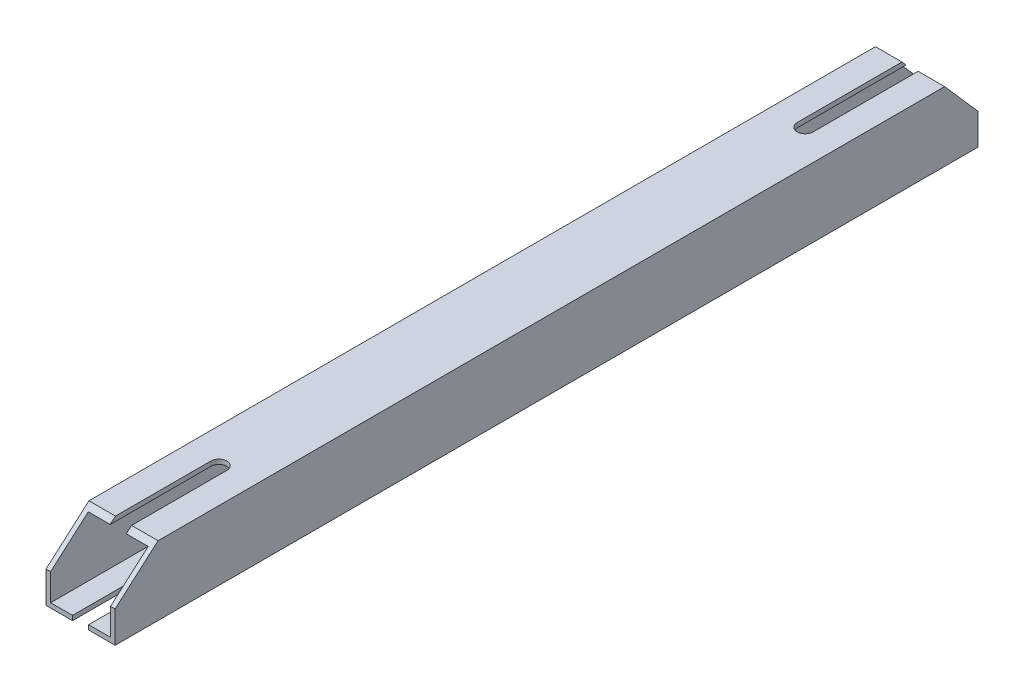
ISO-10303-21;
HEADER;
FILE_DESCRIPTION(('STEP AP214'),'2;1');
FILE_NAME('part.step','',(''),(''),'','','');
FILE_SCHEMA(('AUTOMOTIVE_DESIGN { 1 0 10303 214 1 1 1 1 }'));
ENDSEC;
DATA;
#1=APPLICATION_CONTEXT('core data for automotive mechanical design processes');
#2=APPLICATION_PROTOCOL_DEFINITION('international standard','automotive_design',2000,#1);
#3=PRODUCT_CONTEXT('',#1,'mechanical');
#4=PRODUCT('Part','Part','',(#3));
#5=PRODUCT_RELATED_PRODUCT_CATEGORY('part','',(#4));
#6=PRODUCT_DEFINITION_FORMATION('','',#4);
#7=PRODUCT_DEFINITION_CONTEXT('part definition',#1,'design');
#8=PRODUCT_DEFINITION('design','',#6,#7);
#9=PRODUCT_DEFINITION_SHAPE('','',#8);
#10=(LENGTH_UNIT() NAMED_UNIT(*) SI_UNIT(.MILLI.,.METRE.));
#11=(NAMED_UNIT(*) PLANE_ANGLE_UNIT() SI_UNIT($,.RADIAN.));
#12=(NAMED_UNIT(*) SI_UNIT($,.STERADIAN.) SOLID_ANGLE_UNIT());
#13=UNCERTAINTY_MEASURE_WITH_UNIT(LENGTH_MEASURE(1.E-05),#10,'distance_accuracy_value','');
#14=(GEOMETRIC_REPRESENTATION_CONTEXT(3) GLOBAL_UNCERTAINTY_ASSIGNED_CONTEXT((#13)) GLOBAL_UNIT_ASSIGNED_CONTEXT((#10,
#11,#12)) REPRESENTATION_CONTEXT('',''));
#15=CARTESIAN_POINT('',(0.,0.,0.));
#16=DIRECTION('',(0.,0.,1.));
#17=DIRECTION('',(1.,0.,0.));
#18=AXIS2_PLACEMENT_3D('',#15,#16,#17);
#19=CARTESIAN_POINT('',(7.,-40.,628.8099128));
#20=DIRECTION('',(1.,0.,0.));
#21=DIRECTION('',(0.,1.,0.));
#22=AXIS2_PLACEMENT_3D('',#19,#20,#21);
#23=PLANE('',#22);
#24=DIRECTION('',(0.,-0.659323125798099,0.751859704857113));
#25=VECTOR('',#24,1.);
#26=CARTESIAN_POINT('',(7.,233.82526622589,479.13365130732));
#27=LINE('',#26,#25);
#28=CARTESIAN_POINT('',(7.,30.,711.56597244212));
#29=VERTEX_POINT('',#28);
#30=CARTESIAN_POINT('',(7.,26.,716.12737595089));
#31=VERTEX_POINT('',#30);
#32=EDGE_CURVE('E394',#29,#31,#27,.T.);
#33=ORIENTED_EDGE('',*,*,#32,.F.);
#34=DIRECTION('',(0.,0.,1.));
#35=VECTOR('',#34,1.);
#36=CARTESIAN_POINT('',(7.,30.,314.4049564));
#37=LINE('',#36,#35);
#38=CARTESIAN_POINT('',(7.,30.,628.8099128));
#39=VERTEX_POINT('',#38);
#40=EDGE_CURVE('E171',#39,#29,#37,.T.);
#41=ORIENTED_EDGE('',*,*,#40,.F.);
#42=DIRECTION('',(0.,1.,0.));
#43=VECTOR('',#42,1.);
#44=CARTESIAN_POINT('',(7.,-40.,628.8099128));
#45=LINE('',#44,#43);
#46=CARTESIAN_POINT('',(7.,26.,628.8099128));
#47=VERTEX_POINT('',#46);
#48=EDGE_CURVE('E10',#47,#39,#45,.T.);
#49=ORIENTED_EDGE('',*,*,#48,.F.);
#50=DIRECTION('',(0.,0.,1.));
#51=VECTOR('',#50,1.);
#52=CARTESIAN_POINT('',(7.,26.,314.4049564));
#53=LINE('',#52,#51);
#54=EDGE_CURVE('E168',#47,#31,#53,.T.);
#55=ORIENTED_EDGE('',*,*,#54,.T.);
#56=EDGE_LOOP('',(#33,#41,#49,#55));
#57=FACE_BOUND('',#56,.T.);
#58=ADVANCED_FACE('F16',(#57),#23,.F.);
#59=CARTESIAN_POINT('',(0.,-40.,628.8099128));
#60=DIRECTION('',(0.,1.,0.));
#61=DIRECTION('',(0.,0.,1.));
#62=AXIS2_PLACEMENT_3D('',#59,#60,#61);
#63=CYLINDRICAL_SURFACE('',#62,7.);
#64=CARTESIAN_POINT('',(0.,30.,628.8099128));
#65=DIRECTION('',(0.,1.,0.));
#66=DIRECTION('',(0.,0.,1.));
#67=AXIS2_PLACEMENT_3D('',#64,#65,#66);
#68=CIRCLE('',#67,7.);
#69=CARTESIAN_POINT('',(-7.,30.,628.8099128));
#70=VERTEX_POINT('',#69);
#71=EDGE_CURVE('E447',#39,#70,#68,.T.);
#72=ORIENTED_EDGE('',*,*,#71,.T.);
#73=DIRECTION('',(0.,1.,0.));
#74=VECTOR('',#73,1.);
#75=CARTESIAN_POINT('',(-7.,-40.,628.8099128));
#76=LINE('',#75,#74);
#77=CARTESIAN_POINT('',(-7.,26.,628.8099128));
#78=VERTEX_POINT('',#77);
#79=EDGE_CURVE('E26',#78,#70,#76,.T.);
#80=ORIENTED_EDGE('',*,*,#79,.F.);
#81=CARTESIAN_POINT('',(0.,26.,628.8099128));
#82=DIRECTION('',(0.,1.,0.));
#83=DIRECTION('',(0.,0.,1.));
#84=AXIS2_PLACEMENT_3D('',#81,#82,#83);
#85=CIRCLE('',#84,7.);
#86=EDGE_CURVE('E176',#47,#78,#85,.T.);
#87=ORIENTED_EDGE('',*,*,#86,.F.);
#88=ORIENTED_EDGE('',*,*,#48,.T.);
#89=EDGE_LOOP('',(#72,#80,#87,#88));
#90=FACE_BOUND('',#89,.T.);
#91=ADVANCED_FACE('F18',(#90),#63,.F.);
#92=CARTESIAN_POINT('',(-7.,-40.,628.8099128));
#93=DIRECTION('',(1.,0.,0.));
#94=DIRECTION('',(0.,1.,0.));
#95=AXIS2_PLACEMENT_3D('',#92,#93,#94);
#96=PLANE('',#95);
#97=DIRECTION('',(0.,0.,1.));
#98=VECTOR('',#97,1.);
#99=CARTESIAN_POINT('',(-7.,26.,314.4049564));
#100=LINE('',#99,#98);
#101=CARTESIAN_POINT('',(-7.,26.,716.12737595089));
#102=VERTEX_POINT('',#101);
#103=EDGE_CURVE('E180',#78,#102,#100,.T.);
#104=ORIENTED_EDGE('',*,*,#103,.F.);
#105=ORIENTED_EDGE('',*,*,#79,.T.);
#106=DIRECTION('',(0.,0.,1.));
#107=VECTOR('',#106,1.);
#108=CARTESIAN_POINT('',(-7.,30.,314.4049564));
#109=LINE('',#108,#107);
#110=CARTESIAN_POINT('',(-7.,30.,711.56597244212));
#111=VERTEX_POINT('',#110);
#112=EDGE_CURVE('E443',#70,#111,#109,.T.);
#113=ORIENTED_EDGE('',*,*,#112,.T.);
#114=DIRECTION('',(0.,-0.659323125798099,0.751859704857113));
#115=VECTOR('',#114,1.);
#116=CARTESIAN_POINT('',(-7.,233.82526622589,479.13365130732));
#117=LINE('',#116,#115);
#118=EDGE_CURVE('E237',#111,#102,#117,.T.);
#119=ORIENTED_EDGE('',*,*,#118,.T.);
#120=EDGE_LOOP('',(#104,#105,#113,#119));
#121=FACE_BOUND('',#120,.T.);
#122=ADVANCED_FACE('F467',(#121),#96,.T.);
#123=CARTESIAN_POINT('',(0.,-40.,120.));
#124=DIRECTION('',(0.,1.,0.));
#125=DIRECTION('',(0.,0.,1.));
#126=AXIS2_PLACEMENT_3D('',#123,#124,#125);
#127=CYLINDRICAL_SURFACE('',#126,7.);
#128=CARTESIAN_POINT('',(0.,26.,120.));
#129=DIRECTION('',(0.,1.,0.));
#130=DIRECTION('',(0.,0.,1.));
#131=AXIS2_PLACEMENT_3D('',#128,#129,#130);
#132=CIRCLE('',#131,7.);
#133=CARTESIAN_POINT('',(-7.,26.,120.));
#134=VERTEX_POINT('',#133);
#135=CARTESIAN_POINT('',(0.,26.,127.));
#136=VERTEX_POINT('',#135);
#137=EDGE_CURVE('E159',#134,#136,#132,.T.);
#138=ORIENTED_EDGE('',*,*,#137,.F.);
#139=DIRECTION('',(0.,1.,0.));
#140=VECTOR('',#139,1.);
#141=CARTESIAN_POINT('',(-7.,-40.,120.));
#142=LINE('',#141,#140);
#143=CARTESIAN_POINT('',(-7.,30.,120.));
#144=VERTEX_POINT('',#143);
#145=EDGE_CURVE('E193',#134,#144,#142,.T.);
#146=ORIENTED_EDGE('',*,*,#145,.T.);
#147=CARTESIAN_POINT('',(0.,30.,120.));
#148=DIRECTION('',(0.,1.,0.));
#149=DIRECTION('',(0.,0.,1.));
#150=AXIS2_PLACEMENT_3D('',#147,#148,#149);
#151=CIRCLE('',#150,7.);
#152=CARTESIAN_POINT('',(0.,30.,127.));
#153=VERTEX_POINT('',#152);
#154=EDGE_CURVE('E310',#144,#153,#151,.T.);
#155=ORIENTED_EDGE('',*,*,#154,.T.);
#156=DIRECTION('',(0.,1.,0.));
#157=VECTOR('',#156,1.);
#158=CARTESIAN_POINT('',(0.,-40.,127.));
#159=LINE('',#158,#157);
#160=EDGE_CURVE('E426',#136,#153,#159,.T.);
#161=ORIENTED_EDGE('',*,*,#160,.F.);
#162=EDGE_LOOP('',(#138,#146,#155,#161));
#163=FACE_BOUND('',#162,.T.);
#164=ADVANCED_FACE('F769',(#163),#127,.F.);
#165=CARTESIAN_POINT('',(0.,-40.,120.));
#166=DIRECTION('',(0.,1.,0.));
#167=DIRECTION('',(0.,0.,1.));
#168=AXIS2_PLACEMENT_3D('',#165,#166,#167);
#169=CYLINDRICAL_SURFACE('',#168,7.);
#170=DIRECTION('',(0.,1.,0.));
#171=VECTOR('',#170,1.);
#172=CARTESIAN_POINT('',(7.,-40.,120.));
#173=LINE('',#172,#171);
#174=CARTESIAN_POINT('',(7.,26.,120.));
#175=VERTEX_POINT('',#174);
#176=CARTESIAN_POINT('',(7.,30.,120.));
#177=VERTEX_POINT('',#176);
#178=EDGE_CURVE('E39',#175,#177,#173,.T.);
#179=ORIENTED_EDGE('',*,*,#178,.F.);
#180=CARTESIAN_POINT('',(0.,26.,120.));
#181=DIRECTION('',(0.,1.,0.));
#182=DIRECTION('',(0.,0.,1.));
#183=AXIS2_PLACEMENT_3D('',#180,#181,#182);
#184=CIRCLE('',#183,7.);
#185=EDGE_CURVE('E460',#136,#175,#184,.T.);
#186=ORIENTED_EDGE('',*,*,#185,.F.);
#187=ORIENTED_EDGE('',*,*,#160,.T.);
#188=CARTESIAN_POINT('',(0.,30.,120.));
#189=DIRECTION('',(0.,1.,0.));
#190=DIRECTION('',(0.,0.,1.));
#191=AXIS2_PLACEMENT_3D('',#188,#189,#190);
#192=CIRCLE('',#191,7.);
#193=EDGE_CURVE('E435',#153,#177,#192,.T.);
#194=ORIENTED_EDGE('',*,*,#193,.T.);
#195=EDGE_LOOP('',(#179,#186,#187,#194));
#196=FACE_BOUND('',#195,.T.);
#197=ADVANCED_FACE('F765',(#196),#169,.F.);
#198=CARTESIAN_POINT('',(7.,-40.,-1.));
#199=DIRECTION('',(1.,0.,0.));
#200=DIRECTION('',(0.,1.,0.));
#201=AXIS2_PLACEMENT_3D('',#198,#199,#200);
#202=PLANE('',#201);
#203=DIRECTION('',(0.,0.,1.));
#204=VECTOR('',#203,1.);
#205=CARTESIAN_POINT('',(7.,30.,-0.5));
#206=LINE('',#205,#204);
#207=CARTESIAN_POINT('',(7.,30.,28.967763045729));
#208=VERTEX_POINT('',#207);
#209=EDGE_CURVE('E431',#208,#177,#206,.T.);
#210=ORIENTED_EDGE('',*,*,#209,.F.);
#211=DIRECTION('',(0.,-0.751859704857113,-0.659323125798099));
#212=VECTOR('',#211,1.);
#213=CARTESIAN_POINT('',(7.,-12.87236581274,-8.628003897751));
#214=LINE('',#213,#212);
#215=CARTESIAN_POINT('',(7.,26.,25.460070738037));
#216=VERTEX_POINT('',#215);
#217=EDGE_CURVE('E207',#208,#216,#214,.T.);
#218=ORIENTED_EDGE('',*,*,#217,.T.);
#219=DIRECTION('',(0.,0.,1.));
#220=VECTOR('',#219,1.);
#221=CARTESIAN_POINT('',(7.,26.,-0.5));
#222=LINE('',#221,#220);
#223=EDGE_CURVE('E427',#216,#175,#222,.T.);
#224=ORIENTED_EDGE('',*,*,#223,.T.);
#225=ORIENTED_EDGE('',*,*,#178,.T.);
#226=EDGE_LOOP('',(#210,#218,#224,#225));
#227=FACE_BOUND('',#226,.T.);
#228=ADVANCED_FACE('F762',(#227),#202,.F.);
#229=CARTESIAN_POINT('',(26.,26.,0.));
#230=DIRECTION('',(0.,-1.,0.));
#231=DIRECTION('',(0.,0.,-1.));
#232=AXIS2_PLACEMENT_3D('',#229,#230,#231);
#233=PLANE('',#232);
#234=DIRECTION('',(-1.,0.,0.));
#235=VECTOR('',#234,1.);
#236=CARTESIAN_POINT('',(13.,26.,25.460070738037));
#237=LINE('',#236,#235);
#238=CARTESIAN_POINT('',(26.,26.,25.460070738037));
#239=VERTEX_POINT('',#238);
#240=EDGE_CURVE('E203',#239,#216,#237,.T.);
#241=ORIENTED_EDGE('',*,*,#240,.F.);
#242=DIRECTION('',(0.,0.,1.));
#243=VECTOR('',#242,1.);
#244=CARTESIAN_POINT('',(26.,26.,0.));
#245=LINE('',#244,#243);
#246=CARTESIAN_POINT('',(26.,26.,716.12737595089));
#247=VERTEX_POINT('',#246);
#248=EDGE_CURVE('E221',#239,#247,#245,.T.);
#249=ORIENTED_EDGE('',*,*,#248,.T.);
#250=DIRECTION('',(-1.,0.,0.));
#251=VECTOR('',#250,1.);
#252=CARTESIAN_POINT('',(-12.,26.,716.12737595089));
#253=LINE('',#252,#251);
#254=EDGE_CURVE('E184',#247,#31,#253,.T.);
#255=ORIENTED_EDGE('',*,*,#254,.T.);
#256=ORIENTED_EDGE('',*,*,#54,.F.);
#257=ORIENTED_EDGE('',*,*,#86,.T.);
#258=ORIENTED_EDGE('',*,*,#103,.T.);
#259=DIRECTION('',(-1.,0.,0.));
#260=VECTOR('',#259,1.);
#261=CARTESIAN_POINT('',(-12.,26.,716.12737595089));
#262=LINE('',#261,#260);
#263=CARTESIAN_POINT('',(-26.,26.,716.12737595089));
#264=VERTEX_POINT('',#263);
#265=EDGE_CURVE('E241',#102,#264,#262,.T.);
#266=ORIENTED_EDGE('',*,*,#265,.T.);
#267=DIRECTION('',(0.,0.,1.));
#268=VECTOR('',#267,1.);
#269=CARTESIAN_POINT('',(-26.,26.,0.));
#270=LINE('',#269,#268);
#271=CARTESIAN_POINT('',(-26.,26.,25.460070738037));
#272=VERTEX_POINT('',#271);
#273=EDGE_CURVE('E213',#272,#264,#270,.T.);
#274=ORIENTED_EDGE('',*,*,#273,.F.);
#275=DIRECTION('',(-1.,0.,0.));
#276=VECTOR('',#275,1.);
#277=CARTESIAN_POINT('',(13.,26.,25.460070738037));
#278=LINE('',#277,#276);
#279=CARTESIAN_POINT('',(-7.,26.,25.460070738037));
#280=VERTEX_POINT('',#279);
#281=EDGE_CURVE('E332',#280,#272,#278,.T.);
#282=ORIENTED_EDGE('',*,*,#281,.F.);
#283=DIRECTION('',(0.,0.,1.));
#284=VECTOR('',#283,1.);
#285=CARTESIAN_POINT('',(-7.,26.,-0.5));
#286=LINE('',#285,#284);
#287=EDGE_CURVE('E187',#280,#134,#286,.T.);
#288=ORIENTED_EDGE('',*,*,#287,.T.);
#289=ORIENTED_EDGE('',*,*,#137,.T.);
#290=ORIENTED_EDGE('',*,*,#185,.T.);
#291=ORIENTED_EDGE('',*,*,#223,.F.);
#292=EDGE_LOOP('',(#241,#249,#255,#256,#257,#258,#266,#274,#282,#288,#289,#290,#291));
#293=FACE_BOUND('',#292,.T.);
#294=ADVANCED_FACE('F182',(#293),#233,.T.);
#295=CARTESIAN_POINT('',(-7.,-40.,-1.));
#296=DIRECTION('',(1.,0.,0.));
#297=DIRECTION('',(0.,1.,0.));
#298=AXIS2_PLACEMENT_3D('',#295,#296,#297);
#299=PLANE('',#298);
#300=ORIENTED_EDGE('',*,*,#145,.F.);
#301=ORIENTED_EDGE('',*,*,#287,.F.);
#302=DIRECTION('',(0.,-0.751859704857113,-0.659323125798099));
#303=VECTOR('',#302,1.);
#304=CARTESIAN_POINT('',(-7.,-12.87236581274,-8.628003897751));
#305=LINE('',#304,#303);
#306=CARTESIAN_POINT('',(-7.,30.,28.967763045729));
#307=VERTEX_POINT('',#306);
#308=EDGE_CURVE('E355',#307,#280,#305,.T.);
#309=ORIENTED_EDGE('',*,*,#308,.F.);
#310=DIRECTION('',(0.,0.,1.));
#311=VECTOR('',#310,1.);
#312=CARTESIAN_POINT('',(-7.,30.,-0.5));
#313=LINE('',#312,#311);
#314=EDGE_CURVE('E305',#307,#144,#313,.T.);
#315=ORIENTED_EDGE('',*,*,#314,.T.);
#316=EDGE_LOOP('',(#300,#301,#309,#315));
#317=FACE_BOUND('',#316,.T.);
#318=ADVANCED_FACE('F740',(#317),#299,.T.);
#319=CARTESIAN_POINT('',(-50.,427.05631235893,258.7824583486));
#320=DIRECTION('',(0.,0.751859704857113,0.659323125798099));
#321=DIRECTION('',(1.,0.,0.));
#322=AXIS2_PLACEMENT_3D('',#319,#320,#321);
#323=PLANE('',#322);
#324=DIRECTION('',(-1.,0.,0.));
#325=VECTOR('',#324,1.);
#326=CARTESIAN_POINT('',(-25.,-2.66007077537,748.8099128));
#327=LINE('',#326,#325);
#328=CARTESIAN_POINT('',(-26.,-2.66007077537,748.8099128));
#329=VERTEX_POINT('',#328);
#330=CARTESIAN_POINT('',(-30.,-2.66007077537,748.8099128));
#331=VERTEX_POINT('',#330);
#332=EDGE_CURVE('E371',#329,#331,#327,.T.);
#333=ORIENTED_EDGE('',*,*,#332,.F.);
#334=DIRECTION('',(0.,-0.659323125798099,0.751859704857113));
#335=VECTOR('',#334,1.);
#336=CARTESIAN_POINT('',(-26.,404.02694718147,285.04401512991));
#337=LINE('',#336,#335);
#338=EDGE_CURVE('E209',#264,#329,#337,.T.);
#339=ORIENTED_EDGE('',*,*,#338,.F.);
#340=ORIENTED_EDGE('',*,*,#265,.F.);
#341=ORIENTED_EDGE('',*,*,#118,.F.);
#342=DIRECTION('',(-1.,0.,0.));
#343=VECTOR('',#342,1.);
#344=CARTESIAN_POINT('',(-10.,30.,711.56597244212));
#345=LINE('',#344,#343);
#346=CARTESIAN_POINT('',(-30.,30.,711.56597244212));
#347=VERTEX_POINT('',#346);
#348=EDGE_CURVE('E309',#111,#347,#345,.T.);
#349=ORIENTED_EDGE('',*,*,#348,.T.);
#350=DIRECTION('',(0.,-0.659323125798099,0.751859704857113));
#351=VECTOR('',#350,1.);
#352=CARTESIAN_POINT('',(-30.,404.8963611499,284.05257814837));
#353=LINE('',#352,#351);
#354=EDGE_CURVE('E386',#347,#331,#353,.T.);
#355=ORIENTED_EDGE('',*,*,#354,.T.);
#356=EDGE_LOOP('',(#333,#339,#340,#341,#349,#355));
#357=FACE_BOUND('',#356,.T.);
#358=ADVANCED_FACE('F747',(#357),#323,.T.);
#359=CARTESIAN_POINT('',(-50.,427.05631235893,258.7824583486));
#360=DIRECTION('',(0.,0.751859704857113,0.659323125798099));
#361=DIRECTION('',(1.,0.,0.));
#362=AXIS2_PLACEMENT_3D('',#359,#360,#361);
#363=PLANE('',#362);
#364=DIRECTION('',(-1.,0.,0.));
#365=VECTOR('',#364,1.);
#366=CARTESIAN_POINT('',(-25.,-2.66007077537,748.8099128));
#367=LINE('',#366,#365);
#368=CARTESIAN_POINT('',(30.,-2.66007077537,748.8099128));
#369=VERTEX_POINT('',#368);
#370=CARTESIAN_POINT('',(26.,-2.66007077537,748.8099128));
#371=VERTEX_POINT('',#370);
#372=EDGE_CURVE('E344',#369,#371,#367,.T.);
#373=ORIENTED_EDGE('',*,*,#372,.F.);
#374=DIRECTION('',(0.,0.659323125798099,-0.751859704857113));
#375=VECTOR('',#374,1.);
#376=CARTESIAN_POINT('',(30.,391.85515162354,298.92413287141));
#377=LINE('',#376,#375);
#378=CARTESIAN_POINT('',(30.,30.,711.56597244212));
#379=VERTEX_POINT('',#378);
#380=EDGE_CURVE('E327',#369,#379,#377,.T.);
#381=ORIENTED_EDGE('',*,*,#380,.T.);
#382=DIRECTION('',(-1.,0.,0.));
#383=VECTOR('',#382,1.);
#384=CARTESIAN_POINT('',(-10.,30.,711.56597244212));
#385=LINE('',#384,#383);
#386=EDGE_CURVE('E390',#379,#29,#385,.T.);
#387=ORIENTED_EDGE('',*,*,#386,.T.);
#388=ORIENTED_EDGE('',*,*,#32,.T.);
#389=ORIENTED_EDGE('',*,*,#254,.F.);
#390=DIRECTION('',(0.,0.659323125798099,-0.751859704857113));
#391=VECTOR('',#390,1.);
#392=CARTESIAN_POINT('',(26.,392.72456559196,297.93269588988));
#393=LINE('',#392,#391);
#394=EDGE_CURVE('E414',#371,#247,#393,.T.);
#395=ORIENTED_EDGE('',*,*,#394,.F.);
#396=EDGE_LOOP('',(#373,#381,#387,#388,#389,#395));
#397=FACE_BOUND('',#396,.T.);
#398=ADVANCED_FACE('F750',(#397),#363,.T.);
#399=CARTESIAN_POINT('',(30.,30.,0.));
#400=DIRECTION('',(0.,-1.,0.));
#401=DIRECTION('',(0.,0.,-1.));
#402=AXIS2_PLACEMENT_3D('',#399,#400,#401);
#403=PLANE('',#402);
#404=ORIENTED_EDGE('',*,*,#209,.T.);
#405=ORIENTED_EDGE('',*,*,#193,.F.);
#406=ORIENTED_EDGE('',*,*,#154,.F.);
#407=ORIENTED_EDGE('',*,*,#314,.F.);
#408=DIRECTION('',(-1.,0.,0.));
#409=VECTOR('',#408,1.);
#410=CARTESIAN_POINT('',(15.,30.,28.967763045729));
#411=LINE('',#410,#409);
#412=CARTESIAN_POINT('',(-30.,30.,28.967763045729));
#413=VERTEX_POINT('',#412);
#414=EDGE_CURVE('E402',#307,#413,#411,.T.);
#415=ORIENTED_EDGE('',*,*,#414,.T.);
#416=DIRECTION('',(0.,0.,1.));
#417=VECTOR('',#416,1.);
#418=CARTESIAN_POINT('',(-30.,30.,0.));
#419=LINE('',#418,#417);
#420=EDGE_CURVE('E389',#413,#347,#419,.T.);
#421=ORIENTED_EDGE('',*,*,#420,.T.);
#422=ORIENTED_EDGE('',*,*,#348,.F.);
#423=ORIENTED_EDGE('',*,*,#112,.F.);
#424=ORIENTED_EDGE('',*,*,#71,.F.);
#425=ORIENTED_EDGE('',*,*,#40,.T.);
#426=ORIENTED_EDGE('',*,*,#386,.F.);
#427=DIRECTION('',(0.,0.,1.));
#428=VECTOR('',#427,1.);
#429=CARTESIAN_POINT('',(30.,30.,0.));
#430=LINE('',#429,#428);
#431=CARTESIAN_POINT('',(30.,30.,28.967763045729));
#432=VERTEX_POINT('',#431);
#433=EDGE_CURVE('E323',#432,#379,#430,.T.);
#434=ORIENTED_EDGE('',*,*,#433,.F.);
#435=DIRECTION('',(-1.,0.,0.));
#436=VECTOR('',#435,1.);
#437=CARTESIAN_POINT('',(15.,30.,28.967763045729));
#438=LINE('',#437,#436);
#439=EDGE_CURVE('E423',#432,#208,#438,.T.);
#440=ORIENTED_EDGE('',*,*,#439,.T.);
#441=EDGE_LOOP('',(#404,#405,#406,#407,#415,#421,#422,#423,#424,#425,#426,#434,#440));
#442=FACE_BOUND('',#441,.T.);
#443=ADVANCED_FACE('F471',(#442),#403,.F.);
#444=CARTESIAN_POINT('',(0.,-1.318646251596,1.503719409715));
#445=DIRECTION('',(0.,-0.659323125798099,0.751859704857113));
#446=DIRECTION('',(-1.,0.,0.));
#447=AXIS2_PLACEMENT_3D('',#444,#445,#446);
#448=PLANE('',#447);
#449=ORIENTED_EDGE('',*,*,#240,.T.);
#450=ORIENTED_EDGE('',*,*,#217,.F.);
#451=ORIENTED_EDGE('',*,*,#439,.F.);
#452=DIRECTION('',(0.,0.751859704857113,0.659323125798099));
#453=VECTOR('',#452,1.);
#454=CARTESIAN_POINT('',(30.,-9.798041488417,-5.932057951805));
#455=LINE('',#454,#453);
#456=CARTESIAN_POINT('',(30.,-3.033413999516,0.));
#457=VERTEX_POINT('',#456);
#458=EDGE_CURVE('E282',#457,#432,#455,.T.);
#459=ORIENTED_EDGE('',*,*,#458,.F.);
#460=DIRECTION('',(1.,0.,0.));
#461=VECTOR('',#460,1.);
#462=CARTESIAN_POINT('',(0.,-3.033413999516,0.));
#463=LINE('',#462,#461);
#464=CARTESIAN_POINT('',(26.,-3.033413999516,0.));
#465=VERTEX_POINT('',#464);
#466=EDGE_CURVE('E283',#465,#457,#463,.T.);
#467=ORIENTED_EDGE('',*,*,#466,.F.);
#468=DIRECTION('',(0.,0.751859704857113,0.659323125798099));
#469=VECTOR('',#468,1.);
#470=CARTESIAN_POINT('',(26.,-8.667455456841,-4.940620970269));
#471=LINE('',#470,#469);
#472=EDGE_CURVE('E208',#465,#239,#471,.T.);
#473=ORIENTED_EDGE('',*,*,#472,.T.);
#474=EDGE_LOOP('',(#449,#450,#451,#459,#467,#473));
#475=FACE_BOUND('',#474,.T.);
#476=ADVANCED_FACE('F826',(#475),#448,.F.);
#477=CARTESIAN_POINT('',(26.,-26.,0.));
#478=DIRECTION('',(-1.,0.,0.));
#479=DIRECTION('',(0.,0.,1.));
#480=AXIS2_PLACEMENT_3D('',#477,#478,#479);
#481=PLANE('',#480);
#482=DIRECTION('',(0.,1.,0.));
#483=VECTOR('',#482,1.);
#484=CARTESIAN_POINT('',(26.,-26.,0.));
#485=LINE('',#484,#483);
#486=CARTESIAN_POINT('',(26.,-26.,0.));
#487=VERTEX_POINT('',#486);
#488=EDGE_CURVE('E301',#487,#465,#485,.T.);
#489=ORIENTED_EDGE('',*,*,#488,.F.);
#490=DIRECTION('',(0.,0.,1.));
#491=VECTOR('',#490,1.);
#492=CARTESIAN_POINT('',(26.,-26.,0.));
#493=LINE('',#492,#491);
#494=CARTESIAN_POINT('',(26.,-26.,748.8099128));
#495=VERTEX_POINT('',#494);
#496=EDGE_CURVE('E413',#487,#495,#493,.T.);
#497=ORIENTED_EDGE('',*,*,#496,.T.);
#498=DIRECTION('',(0.,1.,0.));
#499=VECTOR('',#498,1.);
#500=CARTESIAN_POINT('',(26.,-26.,748.8099128));
#501=LINE('',#500,#499);
#502=EDGE_CURVE('E348',#495,#371,#501,.T.);
#503=ORIENTED_EDGE('',*,*,#502,.T.);
#504=ORIENTED_EDGE('',*,*,#394,.T.);
#505=ORIENTED_EDGE('',*,*,#248,.F.);
#506=ORIENTED_EDGE('',*,*,#472,.F.);
#507=EDGE_LOOP('',(#489,#497,#503,#504,#505,#506));
#508=FACE_BOUND('',#507,.T.);
#509=ADVANCED_FACE('F835',(#508),#481,.T.);
#510=CARTESIAN_POINT('',(-26.,-26.,0.));
#511=DIRECTION('',(0.,1.,0.));
#512=DIRECTION('',(1.,0.,0.));
#513=AXIS2_PLACEMENT_3D('',#510,#511,#512);
#514=PLANE('',#513);
#515=DIRECTION('',(1.,0.,0.));
#516=VECTOR('',#515,1.);
#517=CARTESIAN_POINT('',(-26.,-26.,0.));
#518=LINE('',#517,#516);
#519=CARTESIAN_POINT('',(-26.,-26.,0.));
#520=VERTEX_POINT('',#519);
#521=CARTESIAN_POINT('',(-7.,-26.,0.));
#522=VERTEX_POINT('',#521);
#523=EDGE_CURVE('E236',#520,#522,#518,.T.);
#524=ORIENTED_EDGE('',*,*,#523,.F.);
#525=DIRECTION('',(0.,0.,1.));
#526=VECTOR('',#525,1.);
#527=CARTESIAN_POINT('',(-26.,-26.,0.));
#528=LINE('',#527,#526);
#529=CARTESIAN_POINT('',(-26.,-26.,748.8099128));
#530=VERTEX_POINT('',#529);
#531=EDGE_CURVE('E212',#520,#530,#528,.T.);
#532=ORIENTED_EDGE('',*,*,#531,.T.);
#533=DIRECTION('',(1.,0.,0.));
#534=VECTOR('',#533,1.);
#535=CARTESIAN_POINT('',(-26.,-26.,748.8099128));
#536=LINE('',#535,#534);
#537=CARTESIAN_POINT('',(-7.,-26.,748.8099128));
#538=VERTEX_POINT('',#537);
#539=EDGE_CURVE('E379',#530,#538,#536,.T.);
#540=ORIENTED_EDGE('',*,*,#539,.T.);
#541=DIRECTION('',(0.,0.,-1.));
#542=VECTOR('',#541,1.);
#543=CARTESIAN_POINT('',(-7.,-26.,314.4049564));
#544=LINE('',#543,#542);
#545=CARTESIAN_POINT('',(-7.,-26.,628.8099128));
#546=VERTEX_POINT('',#545);
#547=EDGE_CURVE('E292',#538,#546,#544,.T.);
#548=ORIENTED_EDGE('',*,*,#547,.T.);
#549=CARTESIAN_POINT('',(0.,-26.,628.8099128));
#550=DIRECTION('',(0.,1.,0.));
#551=DIRECTION('',(0.,0.,1.));
#552=AXIS2_PLACEMENT_3D('',#549,#550,#551);
#553=CIRCLE('',#552,7.);
#554=CARTESIAN_POINT('',(7.,-26.,628.8099128));
#555=VERTEX_POINT('',#554);
#556=EDGE_CURVE('E293',#555,#546,#553,.T.);
#557=ORIENTED_EDGE('',*,*,#556,.F.);
#558=DIRECTION('',(0.,0.,-1.));
#559=VECTOR('',#558,1.);
#560=CARTESIAN_POINT('',(7.,-26.,314.4049564));
#561=LINE('',#560,#559);
#562=CARTESIAN_POINT('',(7.,-26.,748.8099128));
#563=VERTEX_POINT('',#562);
#564=EDGE_CURVE('E311',#563,#555,#561,.T.);
#565=ORIENTED_EDGE('',*,*,#564,.F.);
#566=DIRECTION('',(1.,0.,0.));
#567=VECTOR('',#566,1.);
#568=CARTESIAN_POINT('',(-26.,-26.,748.8099128));
#569=LINE('',#568,#567);
#570=EDGE_CURVE('E316',#563,#495,#569,.T.);
#571=ORIENTED_EDGE('',*,*,#570,.T.);
#572=ORIENTED_EDGE('',*,*,#496,.F.);
#573=DIRECTION('',(1.,0.,0.));
#574=VECTOR('',#573,1.);
#575=CARTESIAN_POINT('',(-26.,-26.,0.));
#576=LINE('',#575,#574);
#577=CARTESIAN_POINT('',(7.,-26.,0.));
#578=VERTEX_POINT('',#577);
#579=EDGE_CURVE('E297',#578,#487,#576,.T.);
#580=ORIENTED_EDGE('',*,*,#579,.F.);
#581=DIRECTION('',(0.,0.,-1.));
#582=VECTOR('',#581,1.);
#583=CARTESIAN_POINT('',(7.,-26.,-0.5));
#584=LINE('',#583,#582);
#585=CARTESIAN_POINT('',(7.,-26.,120.));
#586=VERTEX_POINT('',#585);
#587=EDGE_CURVE('E277',#586,#578,#584,.T.);
#588=ORIENTED_EDGE('',*,*,#587,.F.);
#589=CARTESIAN_POINT('',(0.,-26.,120.));
#590=DIRECTION('',(0.,1.,0.));
#591=DIRECTION('',(0.,0.,1.));
#592=AXIS2_PLACEMENT_3D('',#589,#590,#591);
#593=CIRCLE('',#592,7.);
#594=CARTESIAN_POINT('',(0.,-26.,127.));
#595=VERTEX_POINT('',#594);
#596=EDGE_CURVE('E273',#595,#586,#593,.T.);
#597=ORIENTED_EDGE('',*,*,#596,.F.);
#598=CARTESIAN_POINT('',(0.,-26.,120.));
#599=DIRECTION('',(0.,1.,0.));
#600=DIRECTION('',(0.,0.,1.));
#601=AXIS2_PLACEMENT_3D('',#598,#599,#600);
#602=CIRCLE('',#601,7.);
#603=CARTESIAN_POINT('',(-7.,-26.,120.));
#604=VERTEX_POINT('',#603);
#605=EDGE_CURVE('E261',#604,#595,#602,.T.);
#606=ORIENTED_EDGE('',*,*,#605,.F.);
#607=DIRECTION('',(0.,0.,-1.));
#608=VECTOR('',#607,1.);
#609=CARTESIAN_POINT('',(-7.,-26.,-0.5));
#610=LINE('',#609,#608);
#611=EDGE_CURVE('E257',#604,#522,#610,.T.);
#612=ORIENTED_EDGE('',*,*,#611,.T.);
#613=EDGE_LOOP('',(#524,#532,#540,#548,#557,#565,#571,#572,#580,#588,#597,#606,#612));
#614=FACE_BOUND('',#613,.T.);
#615=ADVANCED_FACE('F634',(#614),#514,.T.);
#616=CARTESIAN_POINT('',(-26.,26.,0.));
#617=DIRECTION('',(1.,0.,0.));
#618=DIRECTION('',(0.,1.,0.));
#619=AXIS2_PLACEMENT_3D('',#616,#617,#618);
#620=PLANE('',#619);
#621=DIRECTION('',(0.,-0.751859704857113,-0.659323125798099));
#622=VECTOR('',#621,1.);
#623=CARTESIAN_POINT('',(-26.,6.030162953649,7.948059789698));
#624=LINE('',#623,#622);
#625=CARTESIAN_POINT('',(-26.,-3.033413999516,0.));
#626=VERTEX_POINT('',#625);
#627=EDGE_CURVE('E328',#272,#626,#624,.T.);
#628=ORIENTED_EDGE('',*,*,#627,.F.);
#629=ORIENTED_EDGE('',*,*,#273,.T.);
#630=ORIENTED_EDGE('',*,*,#338,.T.);
#631=DIRECTION('',(0.,-1.,0.));
#632=VECTOR('',#631,1.);
#633=CARTESIAN_POINT('',(-26.,26.,748.8099128));
#634=LINE('',#633,#632);
#635=EDGE_CURVE('E382',#329,#530,#634,.T.);
#636=ORIENTED_EDGE('',*,*,#635,.T.);
#637=ORIENTED_EDGE('',*,*,#531,.F.);
#638=DIRECTION('',(0.,-1.,0.));
#639=VECTOR('',#638,1.);
#640=CARTESIAN_POINT('',(-26.,26.,0.));
#641=LINE('',#640,#639);
#642=EDGE_CURVE('E245',#626,#520,#641,.T.);
#643=ORIENTED_EDGE('',*,*,#642,.F.);
#644=EDGE_LOOP('',(#628,#629,#630,#636,#637,#643));
#645=FACE_BOUND('',#644,.T.);
#646=ADVANCED_FACE('F708',(#645),#620,.T.);
#647=CARTESIAN_POINT('',(0.,-1.318646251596,1.503719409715));
#648=DIRECTION('',(0.,-0.659323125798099,0.751859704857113));
#649=DIRECTION('',(-1.,0.,0.));
#650=AXIS2_PLACEMENT_3D('',#647,#648,#649);
#651=PLANE('',#650);
#652=ORIENTED_EDGE('',*,*,#414,.F.);
#653=ORIENTED_EDGE('',*,*,#308,.T.);
#654=ORIENTED_EDGE('',*,*,#281,.T.);
#655=ORIENTED_EDGE('',*,*,#627,.T.);
#656=DIRECTION('',(1.,0.,0.));
#657=VECTOR('',#656,1.);
#658=CARTESIAN_POINT('',(0.,-3.033413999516,0.));
#659=LINE('',#658,#657);
#660=CARTESIAN_POINT('',(-30.,-3.033413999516,0.));
#661=VERTEX_POINT('',#660);
#662=EDGE_CURVE('E249',#661,#626,#659,.T.);
#663=ORIENTED_EDGE('',*,*,#662,.F.);
#664=DIRECTION('',(0.,-0.751859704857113,-0.659323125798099));
#665=VECTOR('',#664,1.);
#666=CARTESIAN_POINT('',(-30.,7.160748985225,8.939496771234));
#667=LINE('',#666,#665);
#668=EDGE_CURVE('E398',#413,#661,#667,.T.);
#669=ORIENTED_EDGE('',*,*,#668,.F.);
#670=EDGE_LOOP('',(#652,#653,#654,#655,#663,#669));
#671=FACE_BOUND('',#670,.T.);
#672=ADVANCED_FACE('F711',(#671),#651,.F.);
#673=CARTESIAN_POINT('',(-30.,30.,0.));
#674=DIRECTION('',(1.,0.,0.));
#675=DIRECTION('',(0.,1.,0.));
#676=AXIS2_PLACEMENT_3D('',#673,#674,#675);
#677=PLANE('',#676);
#678=DIRECTION('',(0.,-1.,0.));
#679=VECTOR('',#678,1.);
#680=CARTESIAN_POINT('',(-30.,30.,0.));
#681=LINE('',#680,#679);
#682=CARTESIAN_POINT('',(-30.,-30.,0.));
#683=VERTEX_POINT('',#682);
#684=EDGE_CURVE('E235',#661,#683,#681,.T.);
#685=ORIENTED_EDGE('',*,*,#684,.T.);
#686=DIRECTION('',(0.,0.,1.));
#687=VECTOR('',#686,1.);
#688=CARTESIAN_POINT('',(-30.,-30.,0.));
#689=LINE('',#688,#687);
#690=CARTESIAN_POINT('',(-30.,-30.,748.8099128));
#691=VERTEX_POINT('',#690);
#692=EDGE_CURVE('E230',#683,#691,#689,.T.);
#693=ORIENTED_EDGE('',*,*,#692,.T.);
#694=DIRECTION('',(0.,-1.,0.));
#695=VECTOR('',#694,1.);
#696=CARTESIAN_POINT('',(-30.,30.,748.8099128));
#697=LINE('',#696,#695);
#698=EDGE_CURVE('E375',#331,#691,#697,.T.);
#699=ORIENTED_EDGE('',*,*,#698,.F.);
#700=ORIENTED_EDGE('',*,*,#354,.F.);
#701=ORIENTED_EDGE('',*,*,#420,.F.);
#702=ORIENTED_EDGE('',*,*,#668,.T.);
#703=EDGE_LOOP('',(#685,#693,#699,#700,#701,#702));
#704=FACE_BOUND('',#703,.T.);
#705=ADVANCED_FACE('F656',(#704),#677,.F.);
#706=CARTESIAN_POINT('',(0.,0.,748.8099128));
#707=DIRECTION('',(0.,0.,1.));
#708=DIRECTION('',(1.,0.,0.));
#709=AXIS2_PLACEMENT_3D('',#706,#707,#708);
#710=PLANE('',#709);
#711=ORIENTED_EDGE('',*,*,#332,.T.);
#712=ORIENTED_EDGE('',*,*,#698,.T.);
#713=DIRECTION('',(1.,0.,0.));
#714=VECTOR('',#713,1.);
#715=CARTESIAN_POINT('',(-30.,-30.,748.8099128));
#716=LINE('',#715,#714);
#717=CARTESIAN_POINT('',(-7.,-30.,748.8099128));
#718=VERTEX_POINT('',#717);
#719=EDGE_CURVE('E226',#691,#718,#716,.T.);
#720=ORIENTED_EDGE('',*,*,#719,.T.);
#721=DIRECTION('',(0.,1.,0.));
#722=VECTOR('',#721,1.);
#723=CARTESIAN_POINT('',(-7.,-20.,748.8099128));
#724=LINE('',#723,#722);
#725=EDGE_CURVE('E367',#718,#538,#724,.T.);
#726=ORIENTED_EDGE('',*,*,#725,.T.);
#727=ORIENTED_EDGE('',*,*,#539,.F.);
#728=ORIENTED_EDGE('',*,*,#635,.F.);
#729=EDGE_LOOP('',(#711,#712,#720,#726,#727,#728));
#730=FACE_BOUND('',#729,.T.);
#731=ADVANCED_FACE('F651',(#730),#710,.T.);
#732=CARTESIAN_POINT('',(-7.,-40.,628.8099128));
#733=DIRECTION('',(1.,0.,0.));
#734=DIRECTION('',(0.,1.,0.));
#735=AXIS2_PLACEMENT_3D('',#732,#733,#734);
#736=PLANE('',#735);
#737=DIRECTION('',(0.,0.,-1.));
#738=VECTOR('',#737,1.);
#739=CARTESIAN_POINT('',(-7.,-30.,314.4049564));
#740=LINE('',#739,#738);
#741=CARTESIAN_POINT('',(-7.,-30.,628.8099128));
#742=VERTEX_POINT('',#741);
#743=EDGE_CURVE('E222',#718,#742,#740,.T.);
#744=ORIENTED_EDGE('',*,*,#743,.T.);
#745=DIRECTION('',(0.,1.,0.));
#746=VECTOR('',#745,1.);
#747=CARTESIAN_POINT('',(-7.,-40.,628.8099128));
#748=LINE('',#747,#746);
#749=EDGE_CURVE('E288',#742,#546,#748,.T.);
#750=ORIENTED_EDGE('',*,*,#749,.T.);
#751=ORIENTED_EDGE('',*,*,#547,.F.);
#752=ORIENTED_EDGE('',*,*,#725,.F.);
#753=EDGE_LOOP('',(#744,#750,#751,#752));
#754=FACE_BOUND('',#753,.T.);
#755=ADVANCED_FACE('F648',(#754),#736,.T.);
#756=CARTESIAN_POINT('',(0.,-40.,628.8099128));
#757=DIRECTION('',(0.,1.,0.));
#758=DIRECTION('',(0.,0.,1.));
#759=AXIS2_PLACEMENT_3D('',#756,#757,#758);
#760=CYLINDRICAL_SURFACE('',#759,7.);
#761=ORIENTED_EDGE('',*,*,#556,.T.);
#762=ORIENTED_EDGE('',*,*,#749,.F.);
#763=CARTESIAN_POINT('',(0.,-30.,628.8099128));
#764=DIRECTION('',(0.,1.,0.));
#765=DIRECTION('',(0.,0.,1.));
#766=AXIS2_PLACEMENT_3D('',#763,#764,#765);
#767=CIRCLE('',#766,7.);
#768=CARTESIAN_POINT('',(7.,-30.,628.8099128));
#769=VERTEX_POINT('',#768);
#770=EDGE_CURVE('E217',#769,#742,#767,.T.);
#771=ORIENTED_EDGE('',*,*,#770,.F.);
#772=DIRECTION('',(0.,1.,0.));
#773=VECTOR('',#772,1.);
#774=CARTESIAN_POINT('',(7.,-40.,628.8099128));
#775=LINE('',#774,#773);
#776=EDGE_CURVE('E315',#769,#555,#775,.T.);
#777=ORIENTED_EDGE('',*,*,#776,.T.);
#778=EDGE_LOOP('',(#761,#762,#771,#777));
#779=FACE_BOUND('',#778,.T.);
#780=ADVANCED_FACE('F645',(#779),#760,.F.);
#781=CARTESIAN_POINT('',(7.,-40.,628.8099128));
#782=DIRECTION('',(1.,0.,0.));
#783=DIRECTION('',(0.,1.,0.));
#784=AXIS2_PLACEMENT_3D('',#781,#782,#783);
#785=PLANE('',#784);
#786=DIRECTION('',(0.,1.,0.));
#787=VECTOR('',#786,1.);
#788=CARTESIAN_POINT('',(7.,-20.,748.8099128));
#789=LINE('',#788,#787);
#790=CARTESIAN_POINT('',(7.,-30.,748.8099128));
#791=VERTEX_POINT('',#790);
#792=EDGE_CURVE('E340',#791,#563,#789,.T.);
#793=ORIENTED_EDGE('',*,*,#792,.T.);
#794=ORIENTED_EDGE('',*,*,#564,.T.);
#795=ORIENTED_EDGE('',*,*,#776,.F.);
#796=DIRECTION('',(0.,0.,-1.));
#797=VECTOR('',#796,1.);
#798=CARTESIAN_POINT('',(7.,-30.,314.4049564));
#799=LINE('',#798,#797);
#800=EDGE_CURVE('E202',#791,#769,#799,.T.);
#801=ORIENTED_EDGE('',*,*,#800,.F.);
#802=EDGE_LOOP('',(#793,#794,#795,#801));
#803=FACE_BOUND('',#802,.T.);
#804=ADVANCED_FACE('F640',(#803),#785,.F.);
#805=CARTESIAN_POINT('',(0.,0.,748.8099128));
#806=DIRECTION('',(0.,0.,1.));
#807=DIRECTION('',(1.,0.,0.));
#808=AXIS2_PLACEMENT_3D('',#805,#806,#807);
#809=PLANE('',#808);
#810=ORIENTED_EDGE('',*,*,#792,.F.);
#811=DIRECTION('',(1.,0.,0.));
#812=VECTOR('',#811,1.);
#813=CARTESIAN_POINT('',(-30.,-30.,748.8099128));
#814=LINE('',#813,#812);
#815=CARTESIAN_POINT('',(30.,-30.,748.8099128));
#816=VERTEX_POINT('',#815);
#817=EDGE_CURVE('E199',#791,#816,#814,.T.);
#818=ORIENTED_EDGE('',*,*,#817,.T.);
#819=DIRECTION('',(0.,1.,0.));
#820=VECTOR('',#819,1.);
#821=CARTESIAN_POINT('',(30.,-30.,748.8099128));
#822=LINE('',#821,#820);
#823=EDGE_CURVE('E336',#816,#369,#822,.T.);
#824=ORIENTED_EDGE('',*,*,#823,.T.);
#825=ORIENTED_EDGE('',*,*,#372,.T.);
#826=ORIENTED_EDGE('',*,*,#502,.F.);
#827=ORIENTED_EDGE('',*,*,#570,.F.);
#828=EDGE_LOOP('',(#810,#818,#824,#825,#826,#827));
#829=FACE_BOUND('',#828,.T.);
#830=ADVANCED_FACE('F638',(#829),#809,.T.);
#831=CARTESIAN_POINT('',(30.,-30.,0.));
#832=DIRECTION('',(-1.,0.,0.));
#833=DIRECTION('',(0.,0.,1.));
#834=AXIS2_PLACEMENT_3D('',#831,#832,#833);
#835=PLANE('',#834);
#836=ORIENTED_EDGE('',*,*,#458,.T.);
#837=ORIENTED_EDGE('',*,*,#433,.T.);
#838=ORIENTED_EDGE('',*,*,#380,.F.);
#839=ORIENTED_EDGE('',*,*,#823,.F.);
#840=DIRECTION('',(0.,0.,1.));
#841=VECTOR('',#840,1.);
#842=CARTESIAN_POINT('',(30.,-30.,0.));
#843=LINE('',#842,#841);
#844=CARTESIAN_POINT('',(30.,-30.,0.));
#845=VERTEX_POINT('',#844);
#846=EDGE_CURVE('E197',#845,#816,#843,.T.);
#847=ORIENTED_EDGE('',*,*,#846,.F.);
#848=DIRECTION('',(0.,1.,0.));
#849=VECTOR('',#848,1.);
#850=CARTESIAN_POINT('',(30.,-30.,0.));
#851=LINE('',#850,#849);
#852=EDGE_CURVE('E278',#845,#457,#851,.T.);
#853=ORIENTED_EDGE('',*,*,#852,.T.);
#854=EDGE_LOOP('',(#836,#837,#838,#839,#847,#853));
#855=FACE_BOUND('',#854,.T.);
#856=ADVANCED_FACE('F534',(#855),#835,.F.);
#857=CARTESIAN_POINT('',(0.,0.,0.));
#858=DIRECTION('',(0.,0.,1.));
#859=DIRECTION('',(1.,0.,0.));
#860=AXIS2_PLACEMENT_3D('',#857,#858,#859);
#861=PLANE('',#860);
#862=ORIENTED_EDGE('',*,*,#579,.T.);
#863=ORIENTED_EDGE('',*,*,#488,.T.);
#864=ORIENTED_EDGE('',*,*,#466,.T.);
#865=ORIENTED_EDGE('',*,*,#852,.F.);
#866=DIRECTION('',(1.,0.,0.));
#867=VECTOR('',#866,1.);
#868=CARTESIAN_POINT('',(-30.,-30.,0.));
#869=LINE('',#868,#867);
#870=CARTESIAN_POINT('',(7.,-30.,0.));
#871=VERTEX_POINT('',#870);
#872=EDGE_CURVE('E513',#871,#845,#869,.T.);
#873=ORIENTED_EDGE('',*,*,#872,.F.);
#874=DIRECTION('',(0.,1.,0.));
#875=VECTOR('',#874,1.);
#876=CARTESIAN_POINT('',(7.,-20.,0.));
#877=LINE('',#876,#875);
#878=EDGE_CURVE('E287',#871,#578,#877,.T.);
#879=ORIENTED_EDGE('',*,*,#878,.T.);
#880=EDGE_LOOP('',(#862,#863,#864,#865,#873,#879));
#881=FACE_BOUND('',#880,.T.);
#882=ADVANCED_FACE('F685',(#881),#861,.F.);
#883=CARTESIAN_POINT('',(7.,-40.,-1.));
#884=DIRECTION('',(1.,0.,0.));
#885=DIRECTION('',(0.,1.,0.));
#886=AXIS2_PLACEMENT_3D('',#883,#884,#885);
#887=PLANE('',#886);
#888=ORIENTED_EDGE('',*,*,#587,.T.);
#889=ORIENTED_EDGE('',*,*,#878,.F.);
#890=DIRECTION('',(0.,0.,-1.));
#891=VECTOR('',#890,1.);
#892=CARTESIAN_POINT('',(7.,-30.,-0.5));
#893=LINE('',#892,#891);
#894=CARTESIAN_POINT('',(7.,-30.,120.));
#895=VERTEX_POINT('',#894);
#896=EDGE_CURVE('E507',#895,#871,#893,.T.);
#897=ORIENTED_EDGE('',*,*,#896,.F.);
#898=DIRECTION('',(0.,1.,0.));
#899=VECTOR('',#898,1.);
#900=CARTESIAN_POINT('',(7.,-40.,120.));
#901=LINE('',#900,#899);
#902=EDGE_CURVE('E269',#895,#586,#901,.T.);
#903=ORIENTED_EDGE('',*,*,#902,.T.);
#904=EDGE_LOOP('',(#888,#889,#897,#903));
#905=FACE_BOUND('',#904,.T.);
#906=ADVANCED_FACE('F684',(#905),#887,.F.);
#907=CARTESIAN_POINT('',(0.,-40.,120.));
#908=DIRECTION('',(0.,1.,0.));
#909=DIRECTION('',(0.,0.,1.));
#910=AXIS2_PLACEMENT_3D('',#907,#908,#909);
#911=CYLINDRICAL_SURFACE('',#910,7.);
#912=ORIENTED_EDGE('',*,*,#902,.F.);
#913=CARTESIAN_POINT('',(0.,-30.,120.));
#914=DIRECTION('',(0.,1.,0.));
#915=DIRECTION('',(0.,0.,1.));
#916=AXIS2_PLACEMENT_3D('',#913,#914,#915);
#917=CIRCLE('',#916,7.);
#918=CARTESIAN_POINT('',(0.,-30.,127.));
#919=VERTEX_POINT('',#918);
#920=EDGE_CURVE('E500',#919,#895,#917,.T.);
#921=ORIENTED_EDGE('',*,*,#920,.F.);
#922=DIRECTION('',(0.,1.,0.));
#923=VECTOR('',#922,1.);
#924=CARTESIAN_POINT('',(0.,-40.,127.));
#925=LINE('',#924,#923);
#926=EDGE_CURVE('E265',#919,#595,#925,.T.);
#927=ORIENTED_EDGE('',*,*,#926,.T.);
#928=ORIENTED_EDGE('',*,*,#596,.T.);
#929=EDGE_LOOP('',(#912,#921,#927,#928));
#930=FACE_BOUND('',#929,.T.);
#931=ADVANCED_FACE('F682',(#930),#911,.F.);
#932=CARTESIAN_POINT('',(0.,-40.,120.));
#933=DIRECTION('',(0.,1.,0.));
#934=DIRECTION('',(0.,0.,1.));
#935=AXIS2_PLACEMENT_3D('',#932,#933,#934);
#936=CYLINDRICAL_SURFACE('',#935,7.);
#937=CARTESIAN_POINT('',(0.,-30.,120.));
#938=DIRECTION('',(0.,1.,0.));
#939=DIRECTION('',(0.,0.,1.));
#940=AXIS2_PLACEMENT_3D('',#937,#938,#939);
#941=CIRCLE('',#940,7.);
#942=CARTESIAN_POINT('',(-7.,-30.,120.));
#943=VERTEX_POINT('',#942);
#944=EDGE_CURVE('E493',#943,#919,#941,.T.);
#945=ORIENTED_EDGE('',*,*,#944,.F.);
#946=DIRECTION('',(0.,1.,0.));
#947=VECTOR('',#946,1.);
#948=CARTESIAN_POINT('',(-7.,-40.,120.));
#949=LINE('',#948,#947);
#950=EDGE_CURVE('E253',#943,#604,#949,.T.);
#951=ORIENTED_EDGE('',*,*,#950,.T.);
#952=ORIENTED_EDGE('',*,*,#605,.T.);
#953=ORIENTED_EDGE('',*,*,#926,.F.);
#954=EDGE_LOOP('',(#945,#951,#952,#953));
#955=FACE_BOUND('',#954,.T.);
#956=ADVANCED_FACE('F678',(#955),#936,.F.);
#957=CARTESIAN_POINT('',(-7.,-40.,-1.));
#958=DIRECTION('',(1.,0.,0.));
#959=DIRECTION('',(0.,1.,0.));
#960=AXIS2_PLACEMENT_3D('',#957,#958,#959);
#961=PLANE('',#960);
#962=ORIENTED_EDGE('',*,*,#950,.F.);
#963=DIRECTION('',(0.,0.,-1.));
#964=VECTOR('',#963,1.);
#965=CARTESIAN_POINT('',(-7.,-30.,-0.5));
#966=LINE('',#965,#964);
#967=CARTESIAN_POINT('',(-7.,-30.,0.));
#968=VERTEX_POINT('',#967);
#969=EDGE_CURVE('E489',#943,#968,#966,.T.);
#970=ORIENTED_EDGE('',*,*,#969,.T.);
#971=DIRECTION('',(0.,1.,0.));
#972=VECTOR('',#971,1.);
#973=CARTESIAN_POINT('',(-7.,-20.,0.));
#974=LINE('',#973,#972);
#975=EDGE_CURVE('E231',#968,#522,#974,.T.);
#976=ORIENTED_EDGE('',*,*,#975,.T.);
#977=ORIENTED_EDGE('',*,*,#611,.F.);
#978=EDGE_LOOP('',(#962,#970,#976,#977));
#979=FACE_BOUND('',#978,.T.);
#980=ADVANCED_FACE('F668',(#979),#961,.T.);
#981=CARTESIAN_POINT('',(0.,0.,0.));
#982=DIRECTION('',(0.,0.,1.));
#983=DIRECTION('',(1.,0.,0.));
#984=AXIS2_PLACEMENT_3D('',#981,#982,#983);
#985=PLANE('',#984);
#986=ORIENTED_EDGE('',*,*,#642,.T.);
#987=ORIENTED_EDGE('',*,*,#523,.T.);
#988=ORIENTED_EDGE('',*,*,#975,.F.);
#989=DIRECTION('',(1.,0.,0.));
#990=VECTOR('',#989,1.);
#991=CARTESIAN_POINT('',(-30.,-30.,0.));
#992=LINE('',#991,#990);
#993=EDGE_CURVE('E488',#683,#968,#992,.T.);
#994=ORIENTED_EDGE('',*,*,#993,.F.);
#995=ORIENTED_EDGE('',*,*,#684,.F.);
#996=ORIENTED_EDGE('',*,*,#662,.T.);
#997=EDGE_LOOP('',(#986,#987,#988,#994,#995,#996));
#998=FACE_BOUND('',#997,.T.);
#999=ADVANCED_FACE('F662',(#998),#985,.F.);
#1000=CARTESIAN_POINT('',(-30.,-30.,0.));
#1001=DIRECTION('',(0.,1.,0.));
#1002=DIRECTION('',(1.,0.,0.));
#1003=AXIS2_PLACEMENT_3D('',#1000,#1001,#1002);
#1004=PLANE('',#1003);
#1005=ORIENTED_EDGE('',*,*,#969,.F.);
#1006=ORIENTED_EDGE('',*,*,#944,.T.);
#1007=ORIENTED_EDGE('',*,*,#920,.T.);
#1008=ORIENTED_EDGE('',*,*,#896,.T.);
#1009=ORIENTED_EDGE('',*,*,#872,.T.);
#1010=ORIENTED_EDGE('',*,*,#846,.T.);
#1011=ORIENTED_EDGE('',*,*,#817,.F.);
#1012=ORIENTED_EDGE('',*,*,#800,.T.);
#1013=ORIENTED_EDGE('',*,*,#770,.T.);
#1014=ORIENTED_EDGE('',*,*,#743,.F.);
#1015=ORIENTED_EDGE('',*,*,#719,.F.);
#1016=ORIENTED_EDGE('',*,*,#692,.F.);
#1017=ORIENTED_EDGE('',*,*,#993,.T.);
#1018=EDGE_LOOP('',(#1005,#1006,#1007,#1008,#1009,#1010,#1011,#1012,#1013,#1014,#1015,#1016,#1017));
#1019=FACE_BOUND('',#1018,.T.);
#1020=ADVANCED_FACE('F528',(#1019),#1004,.F.);
#1021=CLOSED_SHELL('',(#58,#91,#122,#164,#197,#228,#294,#318,#358,#398,#443,#476,#509,#615,#646,
#672,#705,#731,#755,#780,#804,#830,#856,#882,#906,#931,#956,#980,#999,#1020));
#1022=MANIFOLD_SOLID_BREP('B1',#1021);
#1023=ADVANCED_BREP_SHAPE_REPRESENTATION('',(#18,#1022),#14);
#1024=SHAPE_DEFINITION_REPRESENTATION(#9,#1023);
ENDSEC;
END-ISO-10303-21;
